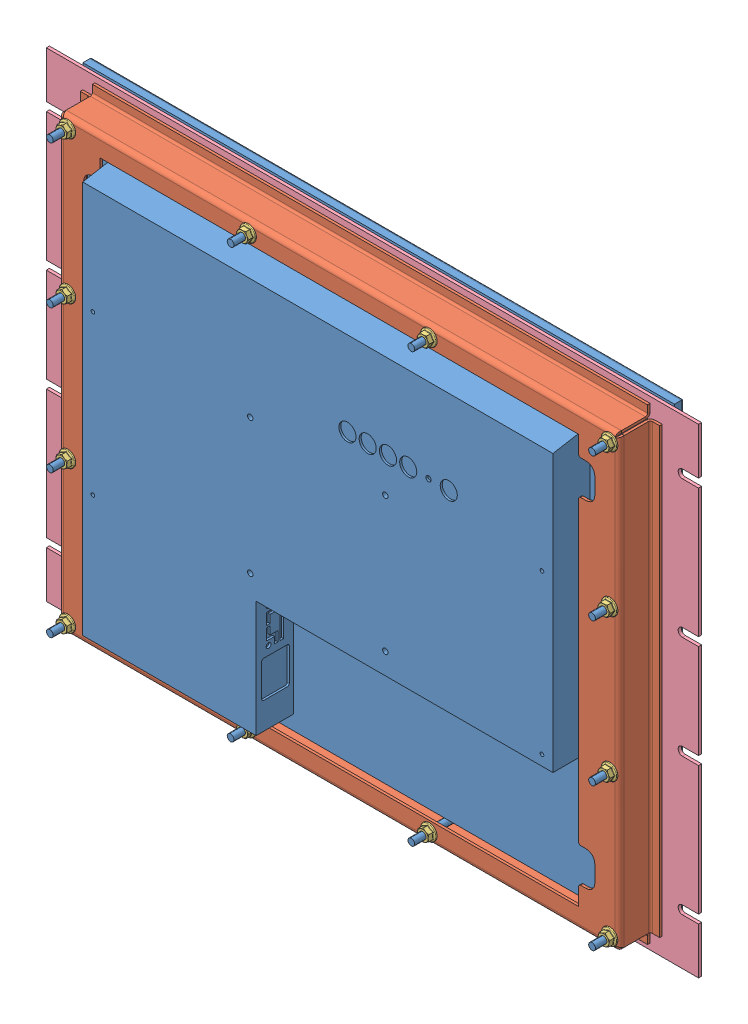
SolidWorks assembly 17 inch Panel Mount Monitor, HIS-RL17-xxxH.SLDASM, configuration Default (file format 13000). Lengths in mm.
Overall size (482.6 354.81 52.12).
15 component instances, 4 part files, 33 mates.
Components (placement in the parent):
- Monitor, 17H-1: Monitor, 17H.sldprt [Default] at (-159.1329 -466.8768 -14.4973) size (437.77 353.57 52.12)
- Collar, 10005-1: Collar, 10005.sldprt [Default] at (-366.5493 -632.9699 14.7191) size (428.69 345.89 24.63)
- M5 Nut, 30008-1: M5 Nut, 30008.sldprt [M5 Nut - 30008] at (-359.7294 -308.3808 19.7191) x (-0.383049 0.923728 0) z (0 0 1) size (11.8 11.8 5)
- M5 Nut, 30008-2: M5 Nut, 30008.sldprt [M5 Nut - 30008] at (-225.9984 -308.3808 19.7191) x (0 -1 0) z (0 0 1) size (11.8 11.8 5)
- M5 Nut, 30008-3: M5 Nut, 30008.sldprt [M5 Nut - 30008] at (-92.2674 -308.3808 19.7191) x (0 -1 0) z (0 0 1) size (11.8 11.8 5)
- M5 Nut, 30008-4: M5 Nut, 30008.sldprt [M5 Nut - 30008] at (41.4636 -308.3808 19.7191) x (0 -1 0) z (0 0 1) size (11.8 11.8 5)
- M5 Nut, 30008-5: M5 Nut, 30008.sldprt [M5 Nut - 30008] at (41.4636 -414.0448 19.7191) x (0 -1 0) z (0 0 1) size (11.8 11.8 5)
- M5 Nut, 30008-6: M5 Nut, 30008.sldprt [M5 Nut - 30008] at (41.4636 -519.7088 19.7191) x (0 -1 0) z (0 0 1) size (11.8 11.8 5)
- M5 Nut, 30008-7: M5 Nut, 30008.sldprt [M5 Nut - 30008] at (41.4636 -625.3728 19.7191) x (0.982823 -0.184551 0) z (0 0 1) size (11.8 11.8 5)
- M5 Nut, 30008-8: M5 Nut, 30008.sldprt [M5 Nut - 30008] at (-92.2674 -625.3728 19.7191) size (11.8 11.8 5)
- M5 Nut, 30008-9: M5 Nut, 30008.sldprt [M5 Nut - 30008] at (-225.9984 -625.3728 19.7191) x (0 1 0) z (0 0 1) size (11.8 11.8 5)
- M5 Nut, 30008-10: M5 Nut, 30008.sldprt [M5 Nut - 30008] at (-359.7294 -625.3728 19.7191) size (11.8 11.8 5)
- M5 Nut, 30008-11: M5 Nut, 30008.sldprt [M5 Nut - 30008] at (-359.7294 -519.7088 19.7191) size (11.8 11.8 5)
- M5 Nut, 30008-12: M5 Nut, 30008.sldprt [M5 Nut - 30008] at (-359.7294 -414.0448 19.7191) size (11.8 11.8 5)
- Rack Adapter, HIS-RL17-1: Rack Adapter, HIS-RL17.SLDPRT [Default] at (-159.1329 -466.8641 -12.1973) x (-1 0 0) z (0 0 1) size (482.6 354.81 2.29)
Mates (geometry in assembly coordinates):
- Concentric1: concentric anti-aligned: cylinder of Monitor, 17H-1 through (41.4636 -308.3808 28.2027) axis (0 0 -1) radius 2.5; cylinder of Collar, 10005-1 through (41.4636 -308.3808 12.8217) axis (0 0 1) radius 3.1877
- Parallel1: parallel anti-aligned: line of Monitor, 17H-1 through (59.7516 -290.0928 -14.4973) axis (-1 0 0); line of Collar, 10005-1 through (-364.4752 -293.9485 -8.0139) axis (1 0 0)
- Concentric21: concentric anti-aligned: cylinder of M5 Nut, 30008-1 through (-359.7294 -308.3808 -5.3185) axis (0 0 1) radius 2.5; cylinder of Monitor, 17H-1 through (-359.7294 -308.3808 28.2027) axis (0 0 -1) radius 2.5
- Coincident11: coincident anti-aligned: plane of Collar, 10005-1 through (-366.5493 -632.9699 14.7191) normal (0 0 1); plane of M5 Nut, 30008-1 through (-363.9959 -310.15 14.7191) normal (0 0 -1)
- Concentric31: concentric aligned: cylinder of M5 Nut, 30008-2 through (-225.9984 -308.3808 -5.3185) axis (0 0 1) radius 2.5; circle of Monitor, 17H-1
- Coincident21: coincident anti-aligned: plane of Collar, 10005-1 through (-366.5493 -632.9699 14.7191) normal (0 0 1); plane of M5 Nut, 30008-2 through (-221.3796 -308.3808 14.7191) normal (0 0 -1)
- Concentric41: concentric aligned: cylinder of M5 Nut, 30008-3 through (-92.2674 -308.3808 -5.3185) axis (0 0 1) radius 2.5; circle of Monitor, 17H-1
- Coincident31: coincident anti-aligned: plane of Collar, 10005-1 through (-366.5493 -632.9699 14.7191) normal (0 0 1); plane of M5 Nut, 30008-3 through (-87.6486 -308.3808 14.7191) normal (0 0 -1)
- Concentric51: concentric aligned: cylinder of M5 Nut, 30008-4 through (41.4636 -308.3808 -5.3185) axis (0 0 1) radius 2.5; circle of Monitor, 17H-1
- Coincident41: coincident anti-aligned: plane of Collar, 10005-1 through (-366.5493 -632.9699 14.7191) normal (0 0 1); plane of M5 Nut, 30008-4 through (46.0824 -308.3808 14.7191) normal (0 0 -1)
- Concentric61: concentric aligned: cylinder of M5 Nut, 30008-5 through (41.4636 -414.0448 -5.3185) axis (0 0 1) radius 2.5; circle of Monitor, 17H-1
- Coincident51: coincident anti-aligned: plane of Collar, 10005-1 through (-366.5493 -632.9699 14.7191) normal (0 0 1); plane of M5 Nut, 30008-5 through (46.0824 -414.0448 14.7191) normal (0 0 -1)
- Concentric71: concentric aligned: cylinder of M5 Nut, 30008-6 through (41.4636 -519.7088 -5.3185) axis (0 0 1) radius 2.5; circle of Monitor, 17H-1
- Coincident61: coincident anti-aligned: plane of Collar, 10005-1 through (-366.5493 -632.9699 14.7191) normal (0 0 1); plane of M5 Nut, 30008-6 through (46.0824 -519.7088 14.7191) normal (0 0 -1)
- Concentric81: concentric aligned: cylinder of M5 Nut, 30008-7 through (41.4636 -625.3728 -5.3185) axis (0 0 1) radius 2.5; circle of Monitor, 17H-1
- Coincident71: coincident anti-aligned: plane of Collar, 10005-1 through (-366.5493 -632.9699 14.7191) normal (0 0 1); plane of M5 Nut, 30008-7 through (42.316 -620.8333 14.7191) normal (0 0 -1)
- Concentric91: concentric aligned: cylinder of M5 Nut, 30008-8 through (-92.2674 -625.3728 -5.3185) axis (0 0 1) radius 2.5; circle of Monitor, 17H-1
- Coincident81: coincident anti-aligned: plane of Collar, 10005-1 through (-366.5493 -632.9699 14.7191) normal (0 0 1); plane of M5 Nut, 30008-8 through (-92.2674 -620.754 14.7191) normal (0 0 -1)
- Concentric101: concentric aligned: cylinder of M5 Nut, 30008-9 through (-225.9984 -625.3728 -5.3185) axis (0 0 1) radius 2.5; circle of Monitor, 17H-1
- Coincident91: coincident anti-aligned: plane of Collar, 10005-1 through (-366.5493 -632.9699 14.7191) normal (0 0 1); plane of M5 Nut, 30008-9 through (-230.6172 -625.3728 14.7191) normal (0 0 -1)
- Concentric111: concentric aligned: cylinder of M5 Nut, 30008-10 through (-359.7294 -625.3728 -5.3185) axis (0 0 1) radius 2.5; circle of Monitor, 17H-1
- Coincident101: coincident anti-aligned: plane of Collar, 10005-1 through (-366.5493 -632.9699 14.7191) normal (0 0 1); plane of M5 Nut, 30008-10 through (-359.7294 -620.754 14.7191) normal (0 0 -1)
- Concentric121: concentric aligned: cylinder of M5 Nut, 30008-11 through (-359.7294 -519.7088 -5.3185) axis (0 0 1) radius 2.5; circle of Monitor, 17H-1
- Coincident111: coincident anti-aligned: plane of Collar, 10005-1 through (-366.5493 -632.9699 14.7191) normal (0 0 1); plane of M5 Nut, 30008-11 through (-359.7294 -515.09 14.7191) normal (0 0 -1)
- Concentric131: concentric aligned: cylinder of M5 Nut, 30008-12 through (-359.7294 -414.0448 -5.3185) axis (0 0 1) radius 2.5; circle of Monitor, 17H-1
- Coincident121: coincident anti-aligned: plane of Collar, 10005-1 through (-366.5493 -632.9699 14.7191) normal (0 0 1); plane of M5 Nut, 30008-12 through (-359.7294 -409.426 14.7191) normal (0 0 -1)
- Coincident122: coincident anti-aligned: plane of Monitor, 17H-1 through (-159.1329 -466.8768 -12.1973) normal (0 0 1); plane of ? through (-159.1329 -466.8768 -12.1973) normal (0 0 -1)
- Width1: width: plane of Monitor, 17H-1 through (-378.0174 -290.0928 -21.6093) normal (0 1 0); plane of Monitor, 17H-1 through (59.7516 -643.6608 -21.6093) normal (0 -1 0); plane of ? through (-362.5869 -305.3328 -10.6733) normal (0 -1 0); plane of ? through (-362.5869 -628.4208 -10.6733) normal (0 1 0)
- Width2: width: plane of Monitor, 17H-1 through (59.7516 -290.0928 -21.6093) normal (1 0 0); plane of Monitor, 17H-1 through (-378.0174 -643.6608 -21.6093) normal (-1 0 0); plane of ? through (44.3211 -305.3328 -10.6733) normal (-1 0 0); plane of ? through (-362.5869 -305.3328 -10.6733) normal (1 0 0)
- Coincident123: coincident anti-aligned: plane of Monitor, 17H-1 through (-159.1329 -466.8768 -12.1973) normal (0 0 1); plane of Rack Adapter, HIS-RL17-1 through (-388.5203 -606.5641 -12.1973) normal (0 0 -1)
- Width3: width anti-aligned: plane of Monitor, 17H-1 through (59.7516 -290.0928 -21.6093) normal (1 0 0); plane of Rack Adapter, HIS-RL17-1 through (-378.0174 -643.6608 -21.6093) normal (-1 0 0); plane of Monitor, 17H-1 through (-400.4329 -330.3391 -9.9113) normal (-1 0 0); plane of Rack Adapter, HIS-RL17-1 through (82.1671 -289.4705 -9.9113) normal (1 0 0)
- Width4: width anti-aligned: plane of Monitor, 17H-1 through (59.7516 -643.6608 -21.6093) normal (0 -1 0); plane of Rack Adapter, HIS-RL17-1 through (-378.0174 -290.0928 -21.6093) normal (0 1 0); plane of Monitor, 17H-1 through (-400.4329 -289.4705 -9.9113) normal (0 1 0); plane of Rack Adapter, HIS-RL17-1 through (-400.4329 -644.2831 -9.9113) normal (0 -1 0)
- Coincident125: coincident anti-aligned: plane of Collar, 10005-1 through (-366.5493 -632.9699 -9.9113) normal (0 0 -1); plane of Rack Adapter, HIS-RL17-1 through (-388.5203 -606.5641 -9.9113) normal (0 0 1)
